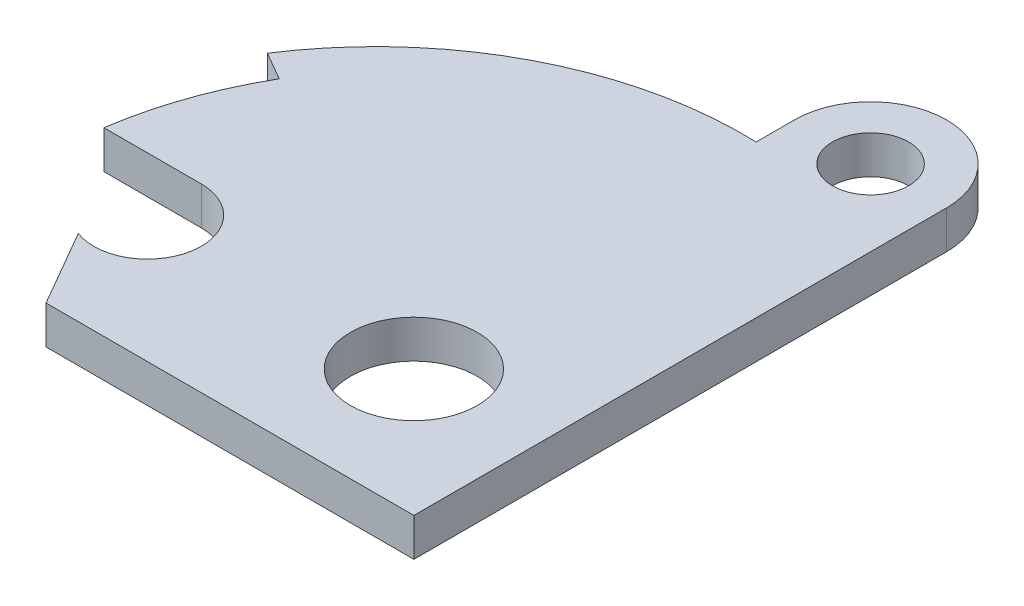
from build123d import *

# Parameters (mm, degrees)
SKETCH1_R      = 3
SKETCH1_R_2    = 5
EXTRUDE1_DEPTH = 3


with BuildPart() as part:
    # Sketch1 → Extrude1 (new body)
    with BuildSketch(Plane(origin=(0, 0, 0), x_dir=(1, 0, 0), z_dir=(0, 1, 0))):
        with BuildLine():
            Line((0, 0), (0, 42))
            ThreePointArc((0, 42), (-6, 48), (-12, 42))
            Line((-12, 42), (-12, 38.982753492))
            ThreePointArc((-12, 38.982753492), (-26.40395085, 35.716416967), (-37.331118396, 25.779628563))
            Line((-37.331118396, 25.779628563), (-35.11473671, 24.5))
            ThreePointArc((-35.11473671, 24.5), (-37.384654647, 19.543620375), (-38.686887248, 14.25))
            Line((-38.686887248, 14.25), (-31, 14.25))
            ThreePointArc((-31, 14.25), (-26.816238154, 9.252579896), (-32.471542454, 6.012887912))
            Line((-32.471542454, 6.012887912), (-29, 0))
            Line((-29, 0), (0, 0))
        make_face()
        with Locations(Location((-6, 42, 0), (0, 0, 270))):
            Circle(SKETCH1_R, mode=Mode.SUBTRACT)
        with Locations(Location((-10, 10, 0), (0, 0, 270))):
            Circle(SKETCH1_R_2, mode=Mode.SUBTRACT)
    extrude(amount=EXTRUDE1_DEPTH)


solid = part.part
